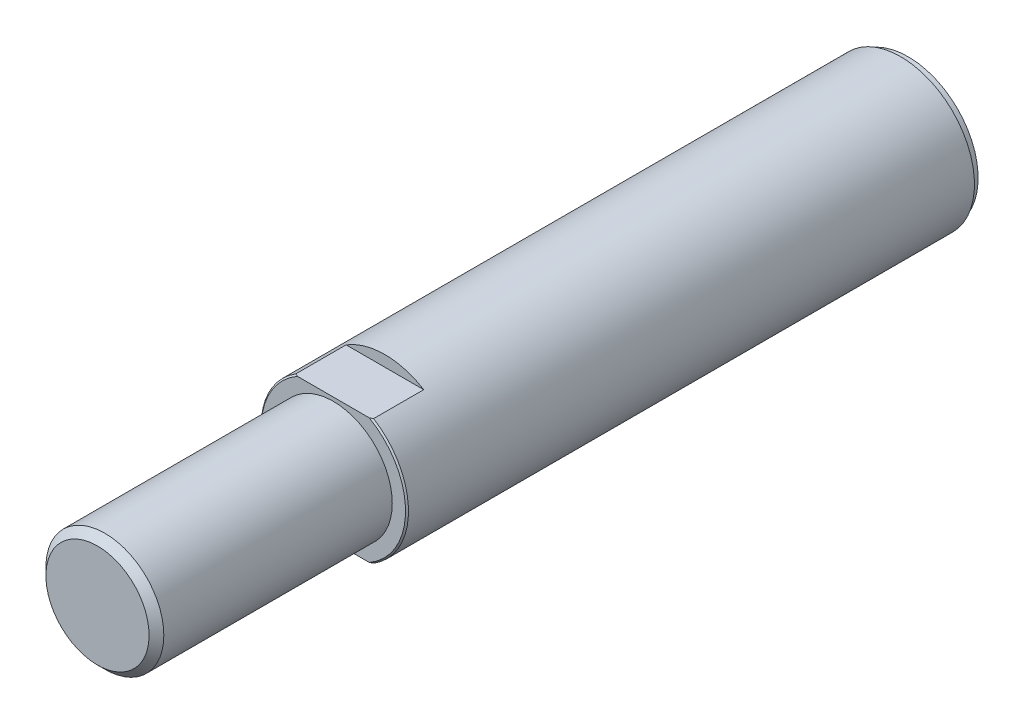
ISO-10303-21;
HEADER;
FILE_DESCRIPTION(('STEP AP214'),'2;1');
FILE_NAME('part.step','',(''),(''),'','','');
FILE_SCHEMA(('AUTOMOTIVE_DESIGN { 1 0 10303 214 1 1 1 1 }'));
ENDSEC;
DATA;
#1=APPLICATION_CONTEXT('core data for automotive mechanical design processes');
#2=APPLICATION_PROTOCOL_DEFINITION('international standard','automotive_design',2000,#1);
#3=PRODUCT_CONTEXT('',#1,'mechanical');
#4=PRODUCT('Part','Part','',(#3));
#5=PRODUCT_RELATED_PRODUCT_CATEGORY('part','',(#4));
#6=PRODUCT_DEFINITION_FORMATION('','',#4);
#7=PRODUCT_DEFINITION_CONTEXT('part definition',#1,'design');
#8=PRODUCT_DEFINITION('design','',#6,#7);
#9=PRODUCT_DEFINITION_SHAPE('','',#8);
#10=(LENGTH_UNIT() NAMED_UNIT(*) SI_UNIT(.MILLI.,.METRE.));
#11=(NAMED_UNIT(*) PLANE_ANGLE_UNIT() SI_UNIT($,.RADIAN.));
#12=(NAMED_UNIT(*) SI_UNIT($,.STERADIAN.) SOLID_ANGLE_UNIT());
#13=UNCERTAINTY_MEASURE_WITH_UNIT(LENGTH_MEASURE(1.E-05),#10,'distance_accuracy_value','');
#14=(GEOMETRIC_REPRESENTATION_CONTEXT(3) GLOBAL_UNCERTAINTY_ASSIGNED_CONTEXT((#13)) GLOBAL_UNIT_ASSIGNED_CONTEXT((#10,
#11,#12)) REPRESENTATION_CONTEXT('',''));
#15=CARTESIAN_POINT('',(0.,0.,0.));
#16=DIRECTION('',(0.,0.,1.));
#17=DIRECTION('',(1.,0.,0.));
#18=AXIS2_PLACEMENT_3D('',#15,#16,#17);
#19=CARTESIAN_POINT('',(0.,0.,110.));
#20=DIRECTION('',(0.,0.,-1.));
#21=DIRECTION('',(-1.,0.,0.));
#22=AXIS2_PLACEMENT_3D('',#19,#20,#21);
#23=CYLINDRICAL_SURFACE('',#22,10.);
#24=CARTESIAN_POINT('',(0.,0.,1.));
#25=DIRECTION('',(0.,0.,-1.));
#26=DIRECTION('',(-1.,0.,0.));
#27=AXIS2_PLACEMENT_3D('',#24,#25,#26);
#28=CIRCLE('',#27,10.);
#29=CARTESIAN_POINT('',(-10.,0.,1.));
#30=VERTEX_POINT('',#29);
#31=EDGE_CURVE('E197',#30,#30,#28,.T.);
#32=ORIENTED_EDGE('',*,*,#31,.F.);
#33=EDGE_LOOP('',(#32));
#34=FACE_BOUND('',#33,.T.);
#35=DIRECTION('',(0.,0.,-1.));
#36=VECTOR('',#35,1.);
#37=CARTESIAN_POINT('',(-5.26782687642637,-8.5,110.));
#38=LINE('',#37,#36);
#39=CARTESIAN_POINT('',(-5.26782687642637,-8.5,77.8));
#40=VERTEX_POINT('',#39);
#41=CARTESIAN_POINT('',(-5.26782687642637,-8.5,71.));
#42=VERTEX_POINT('',#41);
#43=EDGE_CURVE('E209',#40,#42,#38,.T.);
#44=ORIENTED_EDGE('',*,*,#43,.F.);
#45=CARTESIAN_POINT('',(0.,0.,77.8));
#46=DIRECTION('',(0.,0.,1.));
#47=DIRECTION('',(1.,0.,0.));
#48=AXIS2_PLACEMENT_3D('',#45,#46,#47);
#49=CIRCLE('',#48,10.);
#50=CARTESIAN_POINT('',(-5.26782687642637,8.5,77.8));
#51=VERTEX_POINT('',#50);
#52=EDGE_CURVE('E129',#40,#51,#49,.F.);
#53=ORIENTED_EDGE('',*,*,#52,.T.);
#54=DIRECTION('',(0.,0.,-1.));
#55=VECTOR('',#54,1.);
#56=CARTESIAN_POINT('',(-5.26782687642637,8.5,110.));
#57=LINE('',#56,#55);
#58=CARTESIAN_POINT('',(-5.26782687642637,8.5,71.));
#59=VERTEX_POINT('',#58);
#60=EDGE_CURVE('E58',#59,#51,#57,.F.);
#61=ORIENTED_EDGE('',*,*,#60,.F.);
#62=CARTESIAN_POINT('',(0.,0.,71.));
#63=DIRECTION('',(0.,0.,1.));
#64=DIRECTION('',(1.,0.,0.));
#65=AXIS2_PLACEMENT_3D('',#62,#63,#64);
#66=CIRCLE('',#65,10.);
#67=CARTESIAN_POINT('',(5.26782687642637,8.5,71.));
#68=VERTEX_POINT('',#67);
#69=EDGE_CURVE('E47',#68,#59,#66,.T.);
#70=ORIENTED_EDGE('',*,*,#69,.F.);
#71=DIRECTION('',(0.,0.,-1.));
#72=VECTOR('',#71,1.);
#73=CARTESIAN_POINT('',(5.26782687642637,8.5,110.));
#74=LINE('',#73,#72);
#75=CARTESIAN_POINT('',(5.26782687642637,8.5,77.8));
#76=VERTEX_POINT('',#75);
#77=EDGE_CURVE('E214',#76,#68,#74,.T.);
#78=ORIENTED_EDGE('',*,*,#77,.F.);
#79=CARTESIAN_POINT('',(5.26782687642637,-8.5,77.8));
#80=VERTEX_POINT('',#79);
#81=EDGE_CURVE('E116',#76,#80,#49,.F.);
#82=ORIENTED_EDGE('',*,*,#81,.T.);
#83=DIRECTION('',(0.,0.,-1.));
#84=VECTOR('',#83,1.);
#85=CARTESIAN_POINT('',(5.26782687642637,-8.5,110.));
#86=LINE('',#85,#84);
#87=CARTESIAN_POINT('',(5.26782687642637,-8.5,71.));
#88=VERTEX_POINT('',#87);
#89=EDGE_CURVE('E66',#88,#80,#86,.F.);
#90=ORIENTED_EDGE('',*,*,#89,.F.);
#91=EDGE_CURVE('E12',#42,#88,#66,.T.);
#92=ORIENTED_EDGE('',*,*,#91,.F.);
#93=EDGE_LOOP('',(#44,#53,#61,#70,#78,#82,#90,#92));
#94=FACE_BOUND('',#93,.T.);
#95=ADVANCED_FACE('F42',(#34,#94),#23,.T.);
#96=CARTESIAN_POINT('',(0.,0.,78.));
#97=DIRECTION('',(0.,0.,1.));
#98=DIRECTION('',(1.,0.,0.));
#99=AXIS2_PLACEMENT_3D('',#96,#97,#98);
#100=PLANE('',#99);
#101=CARTESIAN_POINT('',(0.,0.,78.));
#102=DIRECTION('',(0.,0.,1.));
#103=DIRECTION('',(1.,0.,0.));
#104=AXIS2_PLACEMENT_3D('',#101,#102,#103);
#105=CIRCLE('',#104,8.);
#106=CARTESIAN_POINT('',(8.,0.,78.));
#107=VERTEX_POINT('',#106);
#108=EDGE_CURVE('E192',#107,#107,#105,.T.);
#109=ORIENTED_EDGE('',*,*,#108,.F.);
#110=EDGE_LOOP('',(#109));
#111=FACE_BOUND('',#110,.T.);
#112=CARTESIAN_POINT('',(0.,0.,78.));
#113=DIRECTION('',(0.,0.,1.));
#114=DIRECTION('',(1.,0.,0.));
#115=AXIS2_PLACEMENT_3D('',#112,#113,#114);
#116=CIRCLE('',#115,9.79999999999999);
#117=CARTESIAN_POINT('',(-4.87749935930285,8.5,78.));
#118=VERTEX_POINT('',#117);
#119=CARTESIAN_POINT('',(-4.87749935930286,-8.5,78.));
#120=VERTEX_POINT('',#119);
#121=EDGE_CURVE('E121',#118,#120,#116,.T.);
#122=ORIENTED_EDGE('',*,*,#121,.T.);
#123=DIRECTION('',(1.,0.,0.));
#124=VECTOR('',#123,1.);
#125=CARTESIAN_POINT('',(-15.7370542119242,-8.5,78.));
#126=LINE('',#125,#124);
#127=CARTESIAN_POINT('',(4.87749935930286,-8.5,78.));
#128=VERTEX_POINT('',#127);
#129=EDGE_CURVE('E108',#120,#128,#126,.T.);
#130=ORIENTED_EDGE('',*,*,#129,.T.);
#131=CARTESIAN_POINT('',(4.87749935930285,8.5,78.));
#132=VERTEX_POINT('',#131);
#133=EDGE_CURVE('E114',#128,#132,#116,.T.);
#134=ORIENTED_EDGE('',*,*,#133,.T.);
#135=DIRECTION('',(-1.,0.,0.));
#136=VECTOR('',#135,1.);
#137=CARTESIAN_POINT('',(-15.7370542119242,8.5,78.));
#138=LINE('',#137,#136);
#139=EDGE_CURVE('E98',#132,#118,#138,.T.);
#140=ORIENTED_EDGE('',*,*,#139,.T.);
#141=EDGE_LOOP('',(#122,#130,#134,#140));
#142=FACE_BOUND('',#141,.T.);
#143=ADVANCED_FACE('F120',(#111,#142),#100,.T.);
#144=CARTESIAN_POINT('',(0.,0.,78.));
#145=DIRECTION('',(0.,0.,-1.));
#146=DIRECTION('',(-1.,0.,0.));
#147=AXIS2_PLACEMENT_3D('',#144,#145,#146);
#148=CONICAL_SURFACE('',#147,9.79999999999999,0.785398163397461);
#149=ORIENTED_EDGE('',*,*,#52,.F.);
#150=CARTESIAN_POINT('',(-20.2924912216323,-8.5,65.7992000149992));
#151=CARTESIAN_POINT('',(-19.9903151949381,-8.5,66.0779050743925));
#152=CARTESIAN_POINT('',(-19.6876831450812,-8.5,66.3561166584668));
#153=CARTESIAN_POINT('',(-19.0813686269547,-8.5,66.9113972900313));
#154=CARTESIAN_POINT('',(-18.777686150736,-8.5,67.1884663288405));
#155=CARTESIAN_POINT('',(-18.1690691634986,-8.5,67.7413636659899));
#156=CARTESIAN_POINT('',(-17.8641343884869,-8.5,68.0171916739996));
#157=CARTESIAN_POINT('',(-17.2529099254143,-8.5,68.5673395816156));
#158=CARTESIAN_POINT('',(-16.9466202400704,-8.5,68.8416594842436));
#159=CARTESIAN_POINT('',(-16.0217547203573,-8.5,69.6653051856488));
#160=CARTESIAN_POINT('',(-15.4008233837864,-8.5,70.21199993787));
#161=CARTESIAN_POINT('',(-14.4631651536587,-8.5,71.0247482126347));
#162=CARTESIAN_POINT('',(-14.1495854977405,-8.5,71.2944346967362));
#163=CARTESIAN_POINT('',(-13.5199535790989,-8.5,71.8309076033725));
#164=CARTESIAN_POINT('',(-13.2039013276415,-8.5,72.0976940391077));
#165=CARTESIAN_POINT('',(-12.6294280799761,-8.5,72.577238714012));
#166=CARTESIAN_POINT('',(-12.3715096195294,-8.5,72.7905987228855));
#167=CARTESIAN_POINT('',(-11.8534786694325,-8.5,73.214637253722));
#168=CARTESIAN_POINT('',(-11.5933661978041,-8.5,73.4253157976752));
#169=CARTESIAN_POINT('',(-11.0705368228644,-8.5,73.8435617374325));
#170=CARTESIAN_POINT('',(-10.807819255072,-8.5,74.0511283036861));
#171=CARTESIAN_POINT('',(-10.2794399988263,-8.5,74.4624820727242));
#172=CARTESIAN_POINT('',(-10.0137783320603,-8.5,74.6662693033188));
#173=CARTESIAN_POINT('',(-9.47930850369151,-8.5,75.069074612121));
#174=CARTESIAN_POINT('',(-9.21050406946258,-8.5,75.2680976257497));
#175=CARTESIAN_POINT('',(-8.66886837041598,-8.5,75.6606243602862));
#176=CARTESIAN_POINT('',(-8.39603694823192,-8.5,75.8541278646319));
#177=CARTESIAN_POINT('',(-7.84577438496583,-8.5,76.2342487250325));
#178=CARTESIAN_POINT('',(-7.56834525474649,-8.5,76.4208689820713));
#179=CARTESIAN_POINT('',(-7.00798119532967,-8.5,76.7856209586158));
#180=CARTESIAN_POINT('',(-6.72504689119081,-8.5,76.9637536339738));
#181=CARTESIAN_POINT('',(-6.15573417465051,-8.5,77.3075212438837));
#182=CARTESIAN_POINT('',(-5.86942405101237,-8.5,77.4732686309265));
#183=CARTESIAN_POINT('',(-5.28944259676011,-8.5,77.7915327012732));
#184=CARTESIAN_POINT('',(-4.99577045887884,-8.5,77.9440479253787));
#185=CARTESIAN_POINT('',(-4.40042128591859,-8.5,78.2320384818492));
#186=CARTESIAN_POINT('',(-4.09875133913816,-8.5,78.3675283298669));
#187=CARTESIAN_POINT('',(-3.48658234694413,-8.5,78.6169596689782));
#188=CARTESIAN_POINT('',(-3.17608589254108,-8.5,78.7309074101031));
#189=CARTESIAN_POINT('',(-2.61467210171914,-8.5,78.9100093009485));
#190=CARTESIAN_POINT('',(-2.36543038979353,-8.5,78.9803861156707));
#191=CARTESIAN_POINT('',(-1.86224774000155,-8.5,79.1018154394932));
#192=CARTESIAN_POINT('',(-1.60830741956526,-8.5,79.1528704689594));
#193=CARTESIAN_POINT('',(-1.09773936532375,-8.5,79.2331036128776));
#194=CARTESIAN_POINT('',(-0.84112221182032,-8.5,79.2623480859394));
#195=CARTESIAN_POINT('',(-0.326281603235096,-8.5,79.29761577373));
#196=CARTESIAN_POINT('',(-0.0680582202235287,-8.5,79.3036400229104));
#197=CARTESIAN_POINT('',(0.448290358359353,-8.5,79.2921082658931));
#198=CARTESIAN_POINT('',(0.706414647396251,-8.5,79.2745123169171));
#199=CARTESIAN_POINT('',(1.22009338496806,-8.5,79.2166761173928));
#200=CARTESIAN_POINT('',(1.47564761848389,-8.5,79.1764339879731));
#201=CARTESIAN_POINT('',(1.98337628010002,-8.5,79.0752276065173));
#202=CARTESIAN_POINT('',(2.23553793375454,-8.5,79.0142001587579));
#203=CARTESIAN_POINT('',(2.73474214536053,-8.5,78.8741177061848));
#204=CARTESIAN_POINT('',(2.98178457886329,-8.5,78.7950622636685));
#205=CARTESIAN_POINT('',(3.5085480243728,-8.5,78.6081486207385));
#206=CARTESIAN_POINT('',(3.78735046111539,-8.5,78.4977206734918));
#207=CARTESIAN_POINT('',(4.33788024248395,-8.5,78.2603215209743));
#208=CARTESIAN_POINT('',(4.60960435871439,-8.5,78.133342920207));
#209=CARTESIAN_POINT('',(5.14688206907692,-8.5,77.8659166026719));
#210=CARTESIAN_POINT('',(5.41242408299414,-8.5,77.7254457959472));
#211=CARTESIAN_POINT('',(5.93752238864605,-8.5,77.4338769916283));
#212=CARTESIAN_POINT('',(6.19707948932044,-8.5,77.2827804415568));
#213=CARTESIAN_POINT('',(6.71410320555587,-8.5,76.9701206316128));
#214=CARTESIAN_POINT('',(6.97150611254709,-8.5,76.8084525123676));
#215=CARTESIAN_POINT('',(7.48168749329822,-8.5,76.4779909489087));
#216=CARTESIAN_POINT('',(7.73446585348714,-8.5,76.3091973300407));
#217=CARTESIAN_POINT('',(8.23576153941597,-8.5,75.965962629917));
#218=CARTESIAN_POINT('',(8.48428301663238,-8.5,75.7915275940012));
#219=CARTESIAN_POINT('',(8.97788664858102,-8.5,75.4378472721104));
#220=CARTESIAN_POINT('',(9.22296865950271,-8.5,75.2586017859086));
#221=CARTESIAN_POINT('',(9.71107470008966,-8.5,74.8954162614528));
#222=CARTESIAN_POINT('',(9.95408734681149,-8.5,74.7114609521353));
#223=CARTESIAN_POINT('',(10.4375034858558,-8.5,74.3401497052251));
#224=CARTESIAN_POINT('',(10.6779069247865,-8.5,74.1527936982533));
#225=CARTESIAN_POINT('',(11.3957533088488,-8.5,73.5863995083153));
#226=CARTESIAN_POINT('',(11.8698018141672,-8.5,73.2030580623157));
#227=CARTESIAN_POINT('',(12.8113026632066,-8.5,72.4276757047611));
#228=CARTESIAN_POINT('',(13.2787496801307,-8.5,72.0356283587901));
#229=CARTESIAN_POINT('',(14.2082094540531,-8.5,71.2451370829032));
#230=CARTESIAN_POINT('',(14.6702221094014,-8.5,70.8466930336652));
#231=CARTESIAN_POINT('',(15.5667112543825,-8.5,70.065095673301));
#232=CARTESIAN_POINT('',(16.0014004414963,-8.5,69.6821858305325));
#233=CARTESIAN_POINT('',(16.867610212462,-8.5,68.9127893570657));
#234=CARTESIAN_POINT('',(17.299130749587,-8.5,68.5263026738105));
#235=CARTESIAN_POINT('',(18.158870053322,-8.5,67.7510598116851));
#236=CARTESIAN_POINT('',(18.5870930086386,-8.5,67.3623082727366));
#237=CARTESIAN_POINT('',(19.4413362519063,-8.5,66.5824227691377));
#238=CARTESIAN_POINT('',(19.8673566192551,-8.5,66.1912888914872));
#239=CARTESIAN_POINT('',(20.2924912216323,-8.5,65.7992000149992));
#240=B_SPLINE_CURVE_WITH_KNOTS('',3,(#150,#151,#152,#153,#154,#155,#156,#157,#158,#159,#160,
#161,#162,#163,#164,#165,#166,#167,#168,#169,#170,#171,#172,#173,#174,#175,#176,#177,#178,#179,
#180,#181,#182,#183,#184,#185,#186,#187,#188,#189,#190,#191,#192,#193,#194,#195,#196,#197,#198,
#199,#200,#201,#202,#203,#204,#205,#206,#207,#208,#209,#210,#211,#212,#213,#214,#215,#216,#217,
#218,#219,#220,#221,#222,#223,#224,#225,#226,#227,#228,#229,#230,#231,#232,#233,#234,#235,#236,
#237,#238,#239),.UNSPECIFIED.,.F.,.F.,(4,2,2,2,2,2,2,2,2,2,2,2,2,2,2,2,2,2,2,2,2,2,2,2,2,2,2,2,
2,2,2,2,2,2,2,2,2,2,2,2,2,2,2,2,4),(0.,1.23324065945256,2.46649067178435,3.7000155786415,
4.9335380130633,7.4153584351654,8.65613838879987,9.89691269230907,10.9010889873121,
11.9052570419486,12.9096881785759,13.9141119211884,14.9174456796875,15.9208187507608,
16.9237639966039,17.9265960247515,18.9187990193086,19.9111112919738,20.9025717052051,
21.8937440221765,22.6700519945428,23.4462586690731,24.2200939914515,24.9938948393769,
25.7690058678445,26.544181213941,27.3217347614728,28.0993071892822,28.9982580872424,
29.897612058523,30.7985335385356,31.6993325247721,32.611075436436,33.5228407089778,
34.4336593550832,35.3445159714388,36.2588393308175,37.1731813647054,39.0019798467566,
40.8321781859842,42.6624107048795,44.4002517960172,46.1381184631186,47.873194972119,
49.6082084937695),.UNSPECIFIED.);
#241=EDGE_CURVE('E230',#40,#120,#240,.T.);
#242=ORIENTED_EDGE('',*,*,#241,.T.);
#243=ORIENTED_EDGE('',*,*,#121,.F.);
#244=CARTESIAN_POINT('',(20.2924912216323,8.5,65.7992000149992));
#245=CARTESIAN_POINT('',(19.9903151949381,8.5,66.0779050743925));
#246=CARTESIAN_POINT('',(19.6876831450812,8.5,66.3561166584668));
#247=CARTESIAN_POINT('',(19.0813686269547,8.5,66.9113972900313));
#248=CARTESIAN_POINT('',(18.777686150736,8.5,67.1884663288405));
#249=CARTESIAN_POINT('',(18.1690691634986,8.5,67.7413636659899));
#250=CARTESIAN_POINT('',(17.8641343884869,8.5,68.0171916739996));
#251=CARTESIAN_POINT('',(17.2529099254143,8.5,68.5673395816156));
#252=CARTESIAN_POINT('',(16.9466202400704,8.5,68.8416594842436));
#253=CARTESIAN_POINT('',(16.0217547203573,8.5,69.6653051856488));
#254=CARTESIAN_POINT('',(15.4008233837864,8.5,70.21199993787));
#255=CARTESIAN_POINT('',(14.4631651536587,8.5,71.0247482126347));
#256=CARTESIAN_POINT('',(14.1495854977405,8.5,71.2944346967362));
#257=CARTESIAN_POINT('',(13.5199535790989,8.5,71.8309076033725));
#258=CARTESIAN_POINT('',(13.2039013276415,8.5,72.0976940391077));
#259=CARTESIAN_POINT('',(12.6294280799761,8.5,72.577238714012));
#260=CARTESIAN_POINT('',(12.3715096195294,8.5,72.7905987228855));
#261=CARTESIAN_POINT('',(11.8534786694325,8.5,73.214637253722));
#262=CARTESIAN_POINT('',(11.5933661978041,8.5,73.4253157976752));
#263=CARTESIAN_POINT('',(11.0705368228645,8.5,73.8435617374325));
#264=CARTESIAN_POINT('',(10.807819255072,8.5,74.0511283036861));
#265=CARTESIAN_POINT('',(10.2794399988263,8.5,74.4624820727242));
#266=CARTESIAN_POINT('',(10.0137783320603,8.5,74.6662693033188));
#267=CARTESIAN_POINT('',(9.47930850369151,8.5,75.069074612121));
#268=CARTESIAN_POINT('',(9.21050406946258,8.5,75.2680976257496));
#269=CARTESIAN_POINT('',(8.66886837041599,8.5,75.6606243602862));
#270=CARTESIAN_POINT('',(8.39603694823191,8.5,75.8541278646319));
#271=CARTESIAN_POINT('',(7.84577438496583,8.5,76.2342487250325));
#272=CARTESIAN_POINT('',(7.56834525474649,8.5,76.4208689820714));
#273=CARTESIAN_POINT('',(7.00798119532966,8.5,76.7856209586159));
#274=CARTESIAN_POINT('',(6.72504689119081,8.5,76.9637536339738));
#275=CARTESIAN_POINT('',(6.15573417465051,8.5,77.3075212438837));
#276=CARTESIAN_POINT('',(5.86942405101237,8.5,77.4732686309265));
#277=CARTESIAN_POINT('',(5.2894425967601,8.5,77.7915327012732));
#278=CARTESIAN_POINT('',(4.99577045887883,8.5,77.9440479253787));
#279=CARTESIAN_POINT('',(4.40042128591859,8.5,78.2320384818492));
#280=CARTESIAN_POINT('',(4.09875133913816,8.5,78.3675283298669));
#281=CARTESIAN_POINT('',(3.48658234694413,8.5,78.6169596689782));
#282=CARTESIAN_POINT('',(3.17608589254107,8.5,78.7309074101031));
#283=CARTESIAN_POINT('',(2.61467210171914,8.5,78.9100093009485));
#284=CARTESIAN_POINT('',(2.36543038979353,8.5,78.9803861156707));
#285=CARTESIAN_POINT('',(1.86224774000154,8.5,79.1018154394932));
#286=CARTESIAN_POINT('',(1.60830741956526,8.5,79.1528704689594));
#287=CARTESIAN_POINT('',(1.09773936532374,8.5,79.2331036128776));
#288=CARTESIAN_POINT('',(0.841122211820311,8.5,79.2623480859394));
#289=CARTESIAN_POINT('',(0.326281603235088,8.5,79.29761577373));
#290=CARTESIAN_POINT('',(0.0680582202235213,8.5,79.3036400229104));
#291=CARTESIAN_POINT('',(-0.448290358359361,8.5,79.2921082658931));
#292=CARTESIAN_POINT('',(-0.706414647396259,8.5,79.2745123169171));
#293=CARTESIAN_POINT('',(-1.22009338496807,8.5,79.2166761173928));
#294=CARTESIAN_POINT('',(-1.47564761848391,8.5,79.1764339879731));
#295=CARTESIAN_POINT('',(-1.98337628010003,8.5,79.0752276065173));
#296=CARTESIAN_POINT('',(-2.23553793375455,8.5,79.0142001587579));
#297=CARTESIAN_POINT('',(-2.73474214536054,8.5,78.8741177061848));
#298=CARTESIAN_POINT('',(-2.98178457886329,8.5,78.7950622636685));
#299=CARTESIAN_POINT('',(-3.5085480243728,8.5,78.6081486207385));
#300=CARTESIAN_POINT('',(-3.7873504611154,8.5,78.4977206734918));
#301=CARTESIAN_POINT('',(-4.33788024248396,8.5,78.2603215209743));
#302=CARTESIAN_POINT('',(-4.6096043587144,8.5,78.133342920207));
#303=CARTESIAN_POINT('',(-5.14688206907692,8.5,77.8659166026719));
#304=CARTESIAN_POINT('',(-5.41242408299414,8.5,77.7254457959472));
#305=CARTESIAN_POINT('',(-5.93752238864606,8.5,77.4338769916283));
#306=CARTESIAN_POINT('',(-6.19707948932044,8.5,77.2827804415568));
#307=CARTESIAN_POINT('',(-6.71410320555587,8.5,76.9701206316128));
#308=CARTESIAN_POINT('',(-6.97150611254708,8.5,76.8084525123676));
#309=CARTESIAN_POINT('',(-7.48168749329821,8.5,76.4779909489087));
#310=CARTESIAN_POINT('',(-7.73446585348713,8.5,76.3091973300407));
#311=CARTESIAN_POINT('',(-8.23576153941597,8.5,75.965962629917));
#312=CARTESIAN_POINT('',(-8.48428301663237,8.5,75.7915275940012));
#313=CARTESIAN_POINT('',(-8.97788664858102,8.5,75.4378472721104));
#314=CARTESIAN_POINT('',(-9.22296865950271,8.5,75.2586017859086));
#315=CARTESIAN_POINT('',(-9.71107470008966,8.5,74.8954162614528));
#316=CARTESIAN_POINT('',(-9.95408734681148,8.5,74.7114609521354));
#317=CARTESIAN_POINT('',(-10.4375034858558,8.5,74.3401497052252));
#318=CARTESIAN_POINT('',(-10.6779069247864,8.5,74.1527936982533));
#319=CARTESIAN_POINT('',(-11.3957533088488,8.5,73.5863995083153));
#320=CARTESIAN_POINT('',(-11.8698018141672,8.5,73.2030580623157));
#321=CARTESIAN_POINT('',(-12.8113026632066,8.5,72.4276757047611));
#322=CARTESIAN_POINT('',(-13.2787496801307,8.5,72.0356283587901));
#323=CARTESIAN_POINT('',(-14.2082094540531,8.5,71.2451370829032));
#324=CARTESIAN_POINT('',(-14.6702221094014,8.5,70.8466930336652));
#325=CARTESIAN_POINT('',(-15.5667112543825,8.5,70.065095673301));
#326=CARTESIAN_POINT('',(-16.0014004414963,8.5,69.6821858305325));
#327=CARTESIAN_POINT('',(-16.867610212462,8.5,68.9127893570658));
#328=CARTESIAN_POINT('',(-17.299130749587,8.5,68.5263026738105));
#329=CARTESIAN_POINT('',(-18.158870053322,8.5,67.7510598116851));
#330=CARTESIAN_POINT('',(-18.5870930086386,8.5,67.3623082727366));
#331=CARTESIAN_POINT('',(-19.4413362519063,8.5,66.5824227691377));
#332=CARTESIAN_POINT('',(-19.8673566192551,8.5,66.1912888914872));
#333=CARTESIAN_POINT('',(-20.2924912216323,8.5,65.7992000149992));
#334=B_SPLINE_CURVE_WITH_KNOTS('',3,(#244,#245,#246,#247,#248,#249,#250,#251,#252,#253,#254,
#255,#256,#257,#258,#259,#260,#261,#262,#263,#264,#265,#266,#267,#268,#269,#270,#271,#272,#273,
#274,#275,#276,#277,#278,#279,#280,#281,#282,#283,#284,#285,#286,#287,#288,#289,#290,#291,#292,
#293,#294,#295,#296,#297,#298,#299,#300,#301,#302,#303,#304,#305,#306,#307,#308,#309,#310,#311,
#312,#313,#314,#315,#316,#317,#318,#319,#320,#321,#322,#323,#324,#325,#326,#327,#328,#329,#330,
#331,#332,#333),.UNSPECIFIED.,.F.,.F.,(4,2,2,2,2,2,2,2,2,2,2,2,2,2,2,2,2,2,2,2,2,2,2,2,2,2,2,2,
2,2,2,2,2,2,2,2,2,2,2,2,2,2,2,2,4),(0.,1.23324065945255,2.46649067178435,3.70001557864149,
4.93353801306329,7.41535843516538,8.65613838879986,9.89691269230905,10.9010889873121,
11.9052570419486,12.9096881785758,13.9141119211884,14.9174456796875,15.9208187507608,
16.9237639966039,17.9265960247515,18.9187990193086,19.9111112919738,20.9025717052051,
21.8937440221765,22.6700519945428,23.4462586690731,24.2200939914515,24.9938948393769,
25.7690058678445,26.544181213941,27.3217347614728,28.0993071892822,28.9982580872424,
29.897612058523,30.7985335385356,31.6993325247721,32.611075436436,33.5228407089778,
34.4336593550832,35.3445159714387,36.2588393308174,37.1731813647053,39.0019798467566,
40.8321781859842,42.6624107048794,44.4002517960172,46.1381184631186,47.873194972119,
49.6082084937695),.UNSPECIFIED.);
#335=EDGE_CURVE('E103',#118,#51,#334,.T.);
#336=ORIENTED_EDGE('',*,*,#335,.T.);
#337=EDGE_LOOP('',(#149,#242,#243,#336));
#338=FACE_BOUND('',#337,.T.);
#339=ADVANCED_FACE('F44',(#338),#148,.T.);
#340=ORIENTED_EDGE('',*,*,#133,.F.);
#341=EDGE_CURVE('E117',#128,#80,#240,.T.);
#342=ORIENTED_EDGE('',*,*,#341,.T.);
#343=ORIENTED_EDGE('',*,*,#81,.F.);
#344=EDGE_CURVE('E101',#76,#132,#334,.T.);
#345=ORIENTED_EDGE('',*,*,#344,.T.);
#346=EDGE_LOOP('',(#340,#342,#343,#345));
#347=FACE_BOUND('',#346,.T.);
#348=ADVANCED_FACE('F113',(#347),#148,.T.);
#349=CARTESIAN_POINT('',(0.,0.,78.));
#350=DIRECTION('',(0.,0.,1.));
#351=DIRECTION('',(1.,0.,0.));
#352=AXIS2_PLACEMENT_3D('',#349,#350,#351);
#353=CYLINDRICAL_SURFACE('',#352,8.);
#354=CARTESIAN_POINT('',(0.,0.,109.));
#355=DIRECTION('',(0.,0.,1.));
#356=DIRECTION('',(1.,0.,0.));
#357=AXIS2_PLACEMENT_3D('',#354,#355,#356);
#358=CIRCLE('',#357,8.);
#359=CARTESIAN_POINT('',(8.,0.,109.));
#360=VERTEX_POINT('',#359);
#361=EDGE_CURVE('E122',#360,#360,#358,.F.);
#362=ORIENTED_EDGE('',*,*,#361,.T.);
#363=EDGE_LOOP('',(#362));
#364=FACE_BOUND('',#363,.T.);
#365=ORIENTED_EDGE('',*,*,#108,.T.);
#366=EDGE_LOOP('',(#365));
#367=FACE_BOUND('',#366,.T.);
#368=ADVANCED_FACE('F169',(#364,#367),#353,.T.);
#369=CARTESIAN_POINT('',(0.,0.,110.));
#370=DIRECTION('',(0.,0.,1.));
#371=DIRECTION('',(1.,0.,0.));
#372=AXIS2_PLACEMENT_3D('',#369,#370,#371);
#373=PLANE('',#372);
#374=CARTESIAN_POINT('',(0.,0.,110.));
#375=DIRECTION('',(0.,0.,1.));
#376=DIRECTION('',(1.,0.,0.));
#377=AXIS2_PLACEMENT_3D('',#374,#375,#376);
#378=CIRCLE('',#377,7.00000000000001);
#379=CARTESIAN_POINT('',(7.00000000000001,0.,110.));
#380=VERTEX_POINT('',#379);
#381=EDGE_CURVE('E125',#380,#380,#378,.T.);
#382=ORIENTED_EDGE('',*,*,#381,.T.);
#383=EDGE_LOOP('',(#382));
#384=FACE_BOUND('',#383,.T.);
#385=ADVANCED_FACE('F159',(#384),#373,.T.);
#386=CARTESIAN_POINT('',(0.,0.,1.));
#387=DIRECTION('',(0.,0.,-1.));
#388=DIRECTION('',(-1.,0.,0.));
#389=AXIS2_PLACEMENT_3D('',#386,#387,#388);
#390=PLANE('',#389);
#391=CARTESIAN_POINT('',(0.,0.,1.));
#392=DIRECTION('',(0.,0.,-1.));
#393=DIRECTION('',(-1.,0.,0.));
#394=AXIS2_PLACEMENT_3D('',#391,#392,#393);
#395=CIRCLE('',#394,9.5);
#396=CARTESIAN_POINT('',(-9.5,0.,1.));
#397=VERTEX_POINT('',#396);
#398=EDGE_CURVE('E200',#397,#397,#395,.T.);
#399=ORIENTED_EDGE('',*,*,#398,.F.);
#400=EDGE_LOOP('',(#399));
#401=FACE_BOUND('',#400,.T.);
#402=ORIENTED_EDGE('',*,*,#31,.T.);
#403=EDGE_LOOP('',(#402));
#404=FACE_BOUND('',#403,.T.);
#405=ADVANCED_FACE('F155',(#401,#404),#390,.T.);
#406=CARTESIAN_POINT('',(0.,0.,1.));
#407=DIRECTION('',(0.,0.,-1.));
#408=DIRECTION('',(-1.,0.,0.));
#409=AXIS2_PLACEMENT_3D('',#406,#407,#408);
#410=CYLINDRICAL_SURFACE('',#409,9.5);
#411=ORIENTED_EDGE('',*,*,#398,.T.);
#412=EDGE_LOOP('',(#411));
#413=FACE_BOUND('',#412,.T.);
#414=CARTESIAN_POINT('',(0.,0.,0.));
#415=DIRECTION('',(0.,0.,-1.));
#416=DIRECTION('',(-1.,0.,0.));
#417=AXIS2_PLACEMENT_3D('',#414,#415,#416);
#418=CIRCLE('',#417,9.5);
#419=CARTESIAN_POINT('',(-9.5,0.,0.));
#420=VERTEX_POINT('',#419);
#421=EDGE_CURVE('E206',#420,#420,#418,.T.);
#422=ORIENTED_EDGE('',*,*,#421,.F.);
#423=EDGE_LOOP('',(#422));
#424=FACE_BOUND('',#423,.T.);
#425=ADVANCED_FACE('F151',(#413,#424),#410,.T.);
#426=CARTESIAN_POINT('',(0.,0.,27.5));
#427=DIRECTION('',(0.,0.,-1.));
#428=DIRECTION('',(-1.,0.,0.));
#429=AXIS2_PLACEMENT_3D('',#426,#427,#428);
#430=CONICAL_SURFACE('',#429,4.24999999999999,1.02974425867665);
#431=CARTESIAN_POINT('',(0.,0.,30.0536576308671));
#432=VERTEX_POINT('',#431);
#433=VERTEX_LOOP('',#432);
#434=FACE_BOUND('',#433,.T.);
#435=CARTESIAN_POINT('',(0.,0.,27.5));
#436=DIRECTION('',(0.,0.,-1.));
#437=DIRECTION('',(-1.,0.,0.));
#438=AXIS2_PLACEMENT_3D('',#435,#436,#437);
#439=CIRCLE('',#438,4.24999999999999);
#440=CARTESIAN_POINT('',(-4.24999999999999,0.,27.5));
#441=VERTEX_POINT('',#440);
#442=EDGE_CURVE('E194',#441,#441,#439,.T.);
#443=ORIENTED_EDGE('',*,*,#442,.T.);
#444=EDGE_LOOP('',(#443));
#445=FACE_BOUND('',#444,.T.);
#446=ADVANCED_FACE('F154',(#434,#445),#430,.F.);
#447=CARTESIAN_POINT('',(0.,0.,0.));
#448=DIRECTION('',(0.,0.,-1.));
#449=DIRECTION('',(-1.,0.,0.));
#450=AXIS2_PLACEMENT_3D('',#447,#448,#449);
#451=CYLINDRICAL_SURFACE('',#450,4.25);
#452=ORIENTED_EDGE('',*,*,#442,.F.);
#453=EDGE_LOOP('',(#452));
#454=FACE_BOUND('',#453,.T.);
#455=CARTESIAN_POINT('',(0.,0.,0.));
#456=DIRECTION('',(0.,0.,-1.));
#457=DIRECTION('',(-1.,0.,0.));
#458=AXIS2_PLACEMENT_3D('',#455,#456,#457);
#459=CIRCLE('',#458,4.25);
#460=CARTESIAN_POINT('',(-4.25,0.,0.));
#461=VERTEX_POINT('',#460);
#462=EDGE_CURVE('E199',#461,#461,#459,.T.);
#463=ORIENTED_EDGE('',*,*,#462,.T.);
#464=EDGE_LOOP('',(#463));
#465=FACE_BOUND('',#464,.T.);
#466=ADVANCED_FACE('F161',(#454,#465),#451,.F.);
#467=CARTESIAN_POINT('',(0.,0.,0.));
#468=DIRECTION('',(0.,0.,1.));
#469=DIRECTION('',(1.,0.,0.));
#470=AXIS2_PLACEMENT_3D('',#467,#468,#469);
#471=PLANE('',#470);
#472=ORIENTED_EDGE('',*,*,#462,.F.);
#473=EDGE_LOOP('',(#472));
#474=FACE_BOUND('',#473,.T.);
#475=ORIENTED_EDGE('',*,*,#421,.T.);
#476=EDGE_LOOP('',(#475));
#477=FACE_BOUND('',#476,.T.);
#478=ADVANCED_FACE('F164',(#474,#477),#471,.F.);
#479=CARTESIAN_POINT('',(0.,0.,110.));
#480=DIRECTION('',(0.,0.,-1.));
#481=DIRECTION('',(-1.,0.,0.));
#482=AXIS2_PLACEMENT_3D('',#479,#480,#481);
#483=CONICAL_SURFACE('',#482,7.00000000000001,0.785398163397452);
#484=ORIENTED_EDGE('',*,*,#361,.F.);
#485=EDGE_LOOP('',(#484));
#486=FACE_BOUND('',#485,.T.);
#487=ORIENTED_EDGE('',*,*,#381,.F.);
#488=EDGE_LOOP('',(#487));
#489=FACE_BOUND('',#488,.T.);
#490=ADVANCED_FACE('F144',(#486,#489),#483,.T.);
#491=CARTESIAN_POINT('',(-15.7370542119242,8.5,71.));
#492=DIRECTION('',(0.,1.,0.));
#493=DIRECTION('',(0.,0.,1.));
#494=AXIS2_PLACEMENT_3D('',#491,#492,#493);
#495=PLANE('',#494);
#496=ORIENTED_EDGE('',*,*,#77,.T.);
#497=DIRECTION('',(-1.,0.,0.));
#498=VECTOR('',#497,1.);
#499=CARTESIAN_POINT('',(-15.7370542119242,8.5,71.));
#500=LINE('',#499,#498);
#501=EDGE_CURVE('E218',#68,#59,#500,.T.);
#502=ORIENTED_EDGE('',*,*,#501,.T.);
#503=ORIENTED_EDGE('',*,*,#60,.T.);
#504=ORIENTED_EDGE('',*,*,#335,.F.);
#505=ORIENTED_EDGE('',*,*,#139,.F.);
#506=ORIENTED_EDGE('',*,*,#344,.F.);
#507=EDGE_LOOP('',(#496,#502,#503,#504,#505,#506));
#508=FACE_BOUND('',#507,.T.);
#509=ADVANCED_FACE('F100',(#508),#495,.T.);
#510=CARTESIAN_POINT('',(0.,0.,71.));
#511=DIRECTION('',(0.,0.,1.));
#512=DIRECTION('',(1.,0.,0.));
#513=AXIS2_PLACEMENT_3D('',#510,#511,#512);
#514=PLANE('',#513);
#515=ORIENTED_EDGE('',*,*,#69,.T.);
#516=ORIENTED_EDGE('',*,*,#501,.F.);
#517=EDGE_LOOP('',(#515,#516));
#518=FACE_BOUND('',#517,.T.);
#519=ADVANCED_FACE('F143',(#518),#514,.T.);
#520=ORIENTED_EDGE('',*,*,#91,.T.);
#521=DIRECTION('',(1.,0.,0.));
#522=VECTOR('',#521,1.);
#523=CARTESIAN_POINT('',(-15.7370542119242,-8.5,71.));
#524=LINE('',#523,#522);
#525=EDGE_CURVE('E217',#42,#88,#524,.T.);
#526=ORIENTED_EDGE('',*,*,#525,.F.);
#527=EDGE_LOOP('',(#520,#526));
#528=FACE_BOUND('',#527,.T.);
#529=ADVANCED_FACE('F149',(#528),#514,.T.);
#530=CARTESIAN_POINT('',(-15.7370542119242,-8.5,71.));
#531=DIRECTION('',(0.,-1.,0.));
#532=DIRECTION('',(0.,0.,-1.));
#533=AXIS2_PLACEMENT_3D('',#530,#531,#532);
#534=PLANE('',#533);
#535=ORIENTED_EDGE('',*,*,#43,.T.);
#536=ORIENTED_EDGE('',*,*,#525,.T.);
#537=ORIENTED_EDGE('',*,*,#89,.T.);
#538=ORIENTED_EDGE('',*,*,#341,.F.);
#539=ORIENTED_EDGE('',*,*,#129,.F.);
#540=ORIENTED_EDGE('',*,*,#241,.F.);
#541=EDGE_LOOP('',(#535,#536,#537,#538,#539,#540));
#542=FACE_BOUND('',#541,.T.);
#543=ADVANCED_FACE('F145',(#542),#534,.T.);
#544=CLOSED_SHELL('',(#95,#143,#339,#348,#368,#385,#405,#425,#446,#466,#478,#490,#509,#519,#529,#543));
#545=MANIFOLD_SOLID_BREP('B2',#544);
#546=ADVANCED_BREP_SHAPE_REPRESENTATION('',(#18,#545),#14);
#547=SHAPE_DEFINITION_REPRESENTATION(#9,#546);
ENDSEC;
END-ISO-10303-21;
